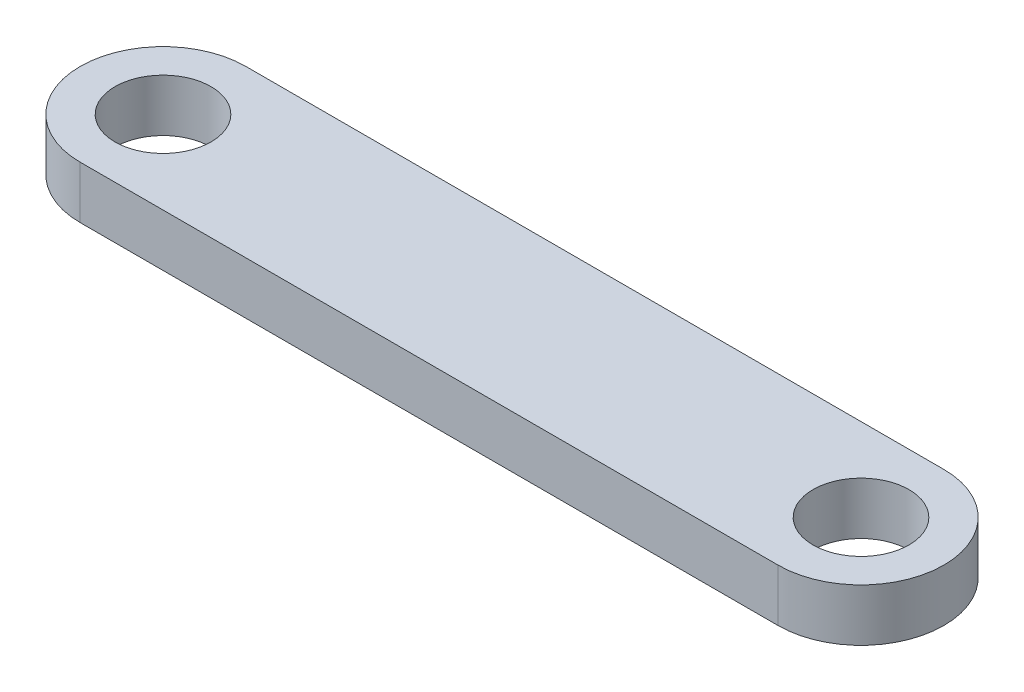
from build123d import *

# Parameters (mm, degrees)
SKETCH1_R           = 2.75
BOSS_EXTRUDE1_DEPTH = 3


with BuildPart() as part:
    # Sketch1 → Boss-Extrude1 (new body)
    with BuildSketch(Plane(origin=(0, 0, 0), x_dir=(1, 0, 0), z_dir=(0, 1, 0))):
        with BuildLine():
            Line((-20, 4.75), (20, 4.75))
            ThreePointArc((20, 4.75), (24.75, 0), (20, -4.75))
            Line((20, -4.75), (-20, -4.75))
            ThreePointArc((-20, -4.75), (-24.75, 0), (-20, 4.75))
        make_face()
        with Locations(Location((-20, 0, 0), (0, 0, 270))):
            Circle(SKETCH1_R, mode=Mode.SUBTRACT)
        with Locations(Location((20, 0, 0), (0, 0, 270))):
            Circle(SKETCH1_R, mode=Mode.SUBTRACT)
    extrude(amount=BOSS_EXTRUDE1_DEPTH)


solid = part.part
